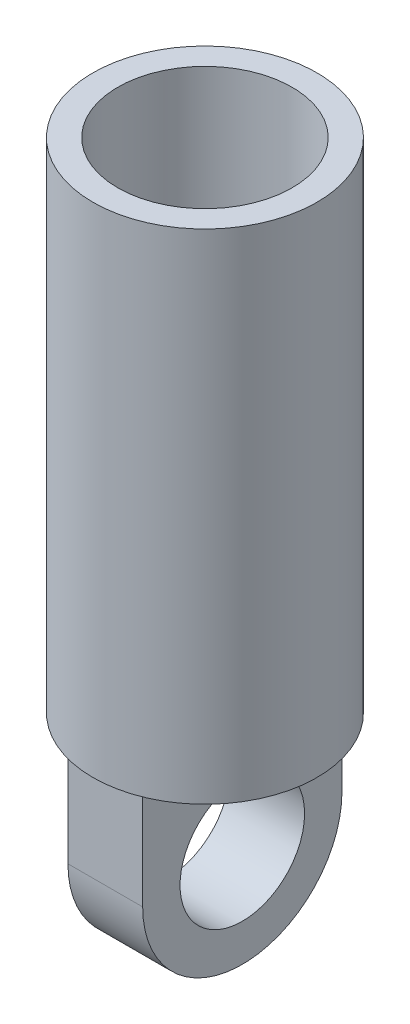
from build123d import *

# Parameters (mm, degrees)
SKETCH1_R           = 62.5
BOSS_EXTRUDE1_DEPTH = 37.5
SKETCH2_R           = 112.5
BOSS_EXTRUDE2_DEPTH = 75
SKETCH2_3_R         = 112.5
SKETCH2_3_R_2       = 87.5
BOSS_EXTRUDE3_DEPTH = 500


with BuildPart() as part:
    # Sketch1 → Boss-Extrude1 (new, symmetric)
    with BuildSketch(Plane(origin=(0, 0, 0), x_dir=(0, 0, -1), z_dir=(1, 0, 0))):
        with BuildLine():
            Line((-100, 0), (-100, 100))
            Line((-100, 100), (100, 100))
            Line((100, 100), (100, 0))
            ThreePointArc((100, 0), (0, -100), (-100, 0))
        make_face()
        Circle(SKETCH1_R, mode=Mode.SUBTRACT)
    extrude(amount=BOSS_EXTRUDE1_DEPTH, both=True)

    # Sketch2 → Boss-Extrude2 (add)
    with BuildSketch(Plane(origin=(0, 100, 0), x_dir=(1, 0, 0), z_dir=(0, 1, 0))):
        with Locations(Location((0, 0, 0), (0, 0, 270))):
            Circle(SKETCH2_R)
    extrude(amount=BOSS_EXTRUDE2_DEPTH)

    # Sketch2_3 → Boss-Extrude3 (add)
    with BuildSketch(Plane(origin=(0, 100, 0), x_dir=(1, 0, 0), z_dir=(0, 1, 0))):
        with Locations(Location((0, 0, 0), (0, 0, 270))):
            Circle(SKETCH2_3_R)
        with Locations(Location((0, 0, 0), (0, 0, 270))):
            Circle(SKETCH2_3_R_2, mode=Mode.SUBTRACT)
    extrude(amount=BOSS_EXTRUDE3_DEPTH)


solid = part.part
